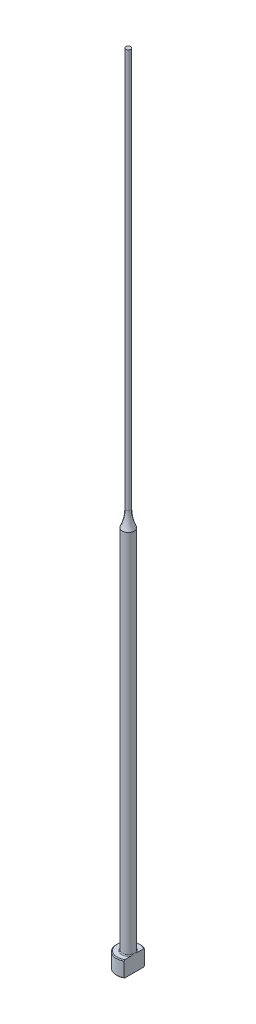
ISO-10303-21;
HEADER;
FILE_DESCRIPTION(('STEP AP214'),'2;1');
FILE_NAME('part.step','',(''),(''),'','','');
FILE_SCHEMA(('AUTOMOTIVE_DESIGN { 1 0 10303 214 1 1 1 1 }'));
ENDSEC;
DATA;
#1=APPLICATION_CONTEXT('core data for automotive mechanical design processes');
#2=APPLICATION_PROTOCOL_DEFINITION('international standard','automotive_design',2000,#1);
#3=PRODUCT_CONTEXT('',#1,'mechanical');
#4=PRODUCT('Part','Part','',(#3));
#5=PRODUCT_RELATED_PRODUCT_CATEGORY('part','',(#4));
#6=PRODUCT_DEFINITION_FORMATION('','',#4);
#7=PRODUCT_DEFINITION_CONTEXT('part definition',#1,'design');
#8=PRODUCT_DEFINITION('design','',#6,#7);
#9=PRODUCT_DEFINITION_SHAPE('','',#8);
#10=(LENGTH_UNIT() NAMED_UNIT(*) SI_UNIT(.MILLI.,.METRE.));
#11=(NAMED_UNIT(*) PLANE_ANGLE_UNIT() SI_UNIT($,.RADIAN.));
#12=(NAMED_UNIT(*) SI_UNIT($,.STERADIAN.) SOLID_ANGLE_UNIT());
#13=UNCERTAINTY_MEASURE_WITH_UNIT(LENGTH_MEASURE(1.E-05),#10,'distance_accuracy_value','');
#14=(GEOMETRIC_REPRESENTATION_CONTEXT(3) GLOBAL_UNCERTAINTY_ASSIGNED_CONTEXT((#13)) GLOBAL_UNIT_ASSIGNED_CONTEXT((#10,
#11,#12)) REPRESENTATION_CONTEXT('',''));
#15=CARTESIAN_POINT('',(0.,0.,0.));
#16=DIRECTION('',(0.,0.,1.));
#17=DIRECTION('',(1.,0.,0.));
#18=AXIS2_PLACEMENT_3D('',#15,#16,#17);
#19=CARTESIAN_POINT('',(-2.99999999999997,4.,0.));
#20=DIRECTION('',(0.,1.,0.));
#21=DIRECTION('',(0.,0.,1.));
#22=AXIS2_PLACEMENT_3D('',#19,#20,#21);
#23=PLANE('',#22);
#24=CARTESIAN_POINT('',(0.,4.,0.));
#25=DIRECTION('',(0.,1.,0.));
#26=DIRECTION('',(0.,0.,1.));
#27=AXIS2_PLACEMENT_3D('',#24,#25,#26);
#28=CIRCLE('',#27,2.79999999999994);
#29=CARTESIAN_POINT('',(1.49999999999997,4.,-2.36431808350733));
#30=VERTEX_POINT('',#29);
#31=CARTESIAN_POINT('',(1.49999999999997,4.,2.36431808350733));
#32=VERTEX_POINT('',#31);
#33=EDGE_CURVE('E187',#30,#32,#28,.T.);
#34=ORIENTED_EDGE('',*,*,#33,.T.);
#35=DIRECTION('',(0.,0.,-1.));
#36=VECTOR('',#35,1.);
#37=CARTESIAN_POINT('',(1.49999999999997,4.,0.));
#38=LINE('',#37,#36);
#39=CARTESIAN_POINT('',(1.49999999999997,3.99999999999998,0.799999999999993));
#40=VERTEX_POINT('',#39);
#41=EDGE_CURVE('E57',#32,#40,#38,.T.);
#42=ORIENTED_EDGE('',*,*,#41,.T.);
#43=CARTESIAN_POINT('',(0.,4.,0.));
#44=DIRECTION('',(0.,1.,0.));
#45=DIRECTION('',(0.,0.,1.));
#46=AXIS2_PLACEMENT_3D('',#43,#44,#45);
#47=CIRCLE('',#46,1.69999999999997);
#48=CARTESIAN_POINT('',(1.49999999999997,3.99999999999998,-0.799999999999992));
#49=VERTEX_POINT('',#48);
#50=EDGE_CURVE('E108',#40,#49,#47,.F.);
#51=ORIENTED_EDGE('',*,*,#50,.T.);
#52=EDGE_CURVE('E137',#49,#30,#38,.T.);
#53=ORIENTED_EDGE('',*,*,#52,.T.);
#54=EDGE_LOOP('',(#34,#42,#51,#53));
#55=FACE_BOUND('',#54,.T.);
#56=ADVANCED_FACE('F32',(#55),#23,.T.);
#57=CARTESIAN_POINT('',(0.,259.958771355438,0.));
#58=DIRECTION('',(0.,1.,0.));
#59=DIRECTION('',(0.,0.,1.));
#60=AXIS2_PLACEMENT_3D('',#57,#58,#59);
#61=CYLINDRICAL_SURFACE('',#60,2.99999999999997);
#62=CARTESIAN_POINT('',(0.,3.79999999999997,0.));
#63=DIRECTION('',(0.,1.,0.));
#64=DIRECTION('',(0.,0.,1.));
#65=AXIS2_PLACEMENT_3D('',#62,#63,#64);
#66=CIRCLE('',#65,2.99999999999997);
#67=CARTESIAN_POINT('',(1.49999999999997,3.79999999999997,2.5980762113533));
#68=VERTEX_POINT('',#67);
#69=CARTESIAN_POINT('',(1.49999999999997,3.79999999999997,-2.5980762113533));
#70=VERTEX_POINT('',#69);
#71=EDGE_CURVE('E105',#68,#70,#66,.F.);
#72=ORIENTED_EDGE('',*,*,#71,.T.);
#73=DIRECTION('',(0.,-1.,0.));
#74=VECTOR('',#73,1.);
#75=CARTESIAN_POINT('',(1.49999999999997,200.,-2.5980762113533));
#76=LINE('',#75,#74);
#77=CARTESIAN_POINT('',(1.49999999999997,0.200000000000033,-2.5980762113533));
#78=VERTEX_POINT('',#77);
#79=EDGE_CURVE('E193',#70,#78,#76,.T.);
#80=ORIENTED_EDGE('',*,*,#79,.T.);
#81=CARTESIAN_POINT('',(0.,0.200000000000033,0.));
#82=DIRECTION('',(0.,-1.,0.));
#83=DIRECTION('',(0.,0.,-1.));
#84=AXIS2_PLACEMENT_3D('',#81,#82,#83);
#85=CIRCLE('',#84,2.99999999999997);
#86=CARTESIAN_POINT('',(1.49999999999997,0.200000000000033,2.5980762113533));
#87=VERTEX_POINT('',#86);
#88=EDGE_CURVE('E100',#78,#87,#85,.F.);
#89=ORIENTED_EDGE('',*,*,#88,.T.);
#90=DIRECTION('',(0.,-1.,0.));
#91=VECTOR('',#90,1.);
#92=CARTESIAN_POINT('',(1.49999999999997,200.,2.5980762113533));
#93=LINE('',#92,#91);
#94=EDGE_CURVE('E93',#68,#87,#93,.T.);
#95=ORIENTED_EDGE('',*,*,#94,.F.);
#96=EDGE_LOOP('',(#72,#80,#89,#95));
#97=FACE_BOUND('',#96,.T.);
#98=ADVANCED_FACE('F158',(#97),#61,.T.);
#99=CARTESIAN_POINT('',(0.,0.,0.));
#100=DIRECTION('',(0.,-1.,0.));
#101=DIRECTION('',(0.,0.,-1.));
#102=AXIS2_PLACEMENT_3D('',#99,#100,#101);
#103=PLANE('',#102);
#104=CARTESIAN_POINT('',(0.,0.,0.));
#105=DIRECTION('',(0.,-1.,0.));
#106=DIRECTION('',(0.,0.,-1.));
#107=AXIS2_PLACEMENT_3D('',#104,#105,#106);
#108=CIRCLE('',#107,2.79999999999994);
#109=CARTESIAN_POINT('',(1.49999999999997,0.,2.36431808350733));
#110=VERTEX_POINT('',#109);
#111=CARTESIAN_POINT('',(1.49999999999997,0.,-2.36431808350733));
#112=VERTEX_POINT('',#111);
#113=EDGE_CURVE('E98',#110,#112,#108,.T.);
#114=ORIENTED_EDGE('',*,*,#113,.T.);
#115=DIRECTION('',(0.,0.,1.));
#116=VECTOR('',#115,1.);
#117=CARTESIAN_POINT('',(1.49999999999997,0.,2.5980762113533));
#118=LINE('',#117,#116);
#119=EDGE_CURVE('E83',#112,#110,#118,.T.);
#120=ORIENTED_EDGE('',*,*,#119,.T.);
#121=EDGE_LOOP('',(#114,#120));
#122=FACE_BOUND('',#121,.T.);
#123=ADVANCED_FACE('F103',(#122),#103,.T.);
#124=CARTESIAN_POINT('',(0.,4.,0.));
#125=DIRECTION('',(0.,-1.,0.));
#126=DIRECTION('',(0.,0.,-1.));
#127=AXIS2_PLACEMENT_3D('',#124,#125,#126);
#128=CONICAL_SURFACE('',#127,2.79999999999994,0.785398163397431);
#129=ORIENTED_EDGE('',*,*,#71,.F.);
#130=CARTESIAN_POINT('',(1.49999999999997,0.888258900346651,5.71827621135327));
#131=CARTESIAN_POINT('',(1.49999999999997,1.01361833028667,5.58866816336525));
#132=CARTESIAN_POINT('',(1.49999999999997,1.13884324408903,5.45892957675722));
#133=CARTESIAN_POINT('',(1.49999999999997,1.38894444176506,5.19911365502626));
#134=CARTESIAN_POINT('',(1.49999999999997,1.51382072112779,5.06903631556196));
#135=CARTESIAN_POINT('',(1.49999999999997,1.76320568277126,4.80840180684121));
#136=CARTESIAN_POINT('',(1.49999999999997,1.88771414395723,4.67784442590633));
#137=CARTESIAN_POINT('',(1.49999999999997,2.13618059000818,4.4162081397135));
#138=CARTESIAN_POINT('',(1.49999999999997,2.26013857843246,4.28512923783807));
#139=CARTESIAN_POINT('',(1.49999999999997,2.50488975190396,4.02490837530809));
#140=CARTESIAN_POINT('',(1.49999999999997,2.62569693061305,3.8957795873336));
#141=CARTESIAN_POINT('',(1.49999999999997,2.86640694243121,3.63668213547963));
#142=CARTESIAN_POINT('',(1.49999999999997,2.98630978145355,3.50671347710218));
#143=CARTESIAN_POINT('',(1.49999999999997,3.22486033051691,3.24567921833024));
#144=CARTESIAN_POINT('',(1.49999999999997,3.3435083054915,3.11461386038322));
#145=CARTESIAN_POINT('',(1.49999999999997,3.5790771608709,2.85094268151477));
#146=CARTESIAN_POINT('',(1.49999999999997,3.69599811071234,2.71833692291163));
#147=CARTESIAN_POINT('',(1.49999999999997,3.88262371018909,2.50255231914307));
#148=CARTESIAN_POINT('',(1.49999999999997,3.95312454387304,2.42006293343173));
#149=CARTESIAN_POINT('',(1.49999999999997,4.09287098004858,2.254010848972));
#150=CARTESIAN_POINT('',(1.49999999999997,4.16211645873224,2.17044804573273));
#151=CARTESIAN_POINT('',(1.49999999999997,4.29964684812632,2.00105967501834));
#152=CARTESIAN_POINT('',(1.49999999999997,4.36791386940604,1.9152195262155));
#153=CARTESIAN_POINT('',(1.49999999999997,4.50205840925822,1.7417139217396));
#154=CARTESIAN_POINT('',(1.49999999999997,4.56793649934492,1.65404891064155));
#155=CARTESIAN_POINT('',(1.49999999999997,4.69728151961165,1.47490236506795));
#156=CARTESIAN_POINT('',(1.49999999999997,4.76069661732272,1.38338308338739));
#157=CARTESIAN_POINT('',(1.49999999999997,4.88239539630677,1.19675661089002));
#158=CARTESIAN_POINT('',(1.49999999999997,4.94067201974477,1.10164473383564));
#159=CARTESIAN_POINT('',(1.49999999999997,5.048413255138,0.908008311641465));
#160=CARTESIAN_POINT('',(1.49999999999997,5.09797809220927,0.809540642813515));
#161=CARTESIAN_POINT('',(1.49999999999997,5.18432188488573,0.607192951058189));
#162=CARTESIAN_POINT('',(1.49999999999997,5.22114374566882,0.50333247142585));
#163=CARTESIAN_POINT('',(1.49999999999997,5.26099935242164,0.347577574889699));
#164=CARTESIAN_POINT('',(1.49999999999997,5.2715702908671,0.297609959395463));
#165=CARTESIAN_POINT('',(1.49999999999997,5.28794860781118,0.196885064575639));
#166=CARTESIAN_POINT('',(1.49999999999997,5.29375640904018,0.146127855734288));
#167=CARTESIAN_POINT('',(1.49999999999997,5.30019707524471,0.0444388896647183));
#168=CARTESIAN_POINT('',(1.49999999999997,5.30084594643,-0.00649183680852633));
#169=CARTESIAN_POINT('',(1.49999999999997,5.29696416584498,-0.108155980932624));
#170=CARTESIAN_POINT('',(1.49999999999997,5.29243308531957,-0.158889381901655));
#171=CARTESIAN_POINT('',(1.49999999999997,5.27856915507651,-0.259234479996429));
#172=CARTESIAN_POINT('',(1.49999999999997,5.2692782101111,-0.308852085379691));
#173=CARTESIAN_POINT('',(1.49999999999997,5.24647108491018,-0.407110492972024));
#174=CARTESIAN_POINT('',(1.49999999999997,5.23295324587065,-0.45575090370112));
#175=CARTESIAN_POINT('',(1.49999999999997,5.20226175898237,-0.55214996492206));
#176=CARTESIAN_POINT('',(1.49999999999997,5.18506801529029,-0.599902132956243));
#177=CARTESIAN_POINT('',(1.49999999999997,5.1477138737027,-0.694205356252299));
#178=CARTESIAN_POINT('',(1.49999999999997,5.12755408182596,-0.740756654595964));
#179=CARTESIAN_POINT('',(1.49999999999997,5.0632769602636,-0.879166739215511));
#180=CARTESIAN_POINT('',(1.49999999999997,5.01551721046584,-0.969329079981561));
#181=CARTESIAN_POINT('',(1.49999999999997,4.91367909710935,-1.14604316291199));
#182=CARTESIAN_POINT('',(1.49999999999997,4.85959300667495,-1.2325903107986));
#183=CARTESIAN_POINT('',(1.49999999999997,4.74697968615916,-1.40321348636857));
#184=CARTESIAN_POINT('',(1.49999999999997,4.68843573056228,-1.4872783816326));
#185=CARTESIAN_POINT('',(1.49999999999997,4.5684384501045,-1.65322187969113));
#186=CARTESIAN_POINT('',(1.49999999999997,4.50698656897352,-1.73510153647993));
#187=CARTESIAN_POINT('',(1.49999999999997,4.3811567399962,-1.89829823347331));
#188=CARTESIAN_POINT('',(1.49999999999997,4.31675092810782,-1.97959369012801));
#189=CARTESIAN_POINT('',(1.49999999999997,4.18634068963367,-2.14090082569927));
#190=CARTESIAN_POINT('',(1.49999999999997,4.12033609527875,-2.22091236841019));
#191=CARTESIAN_POINT('',(1.49999999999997,3.92086431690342,-2.45906508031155));
#192=CARTESIAN_POINT('',(1.49999999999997,3.78562663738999,-2.61572090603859));
#193=CARTESIAN_POINT('',(1.49999999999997,3.53554498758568,-2.90006295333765));
#194=CARTESIAN_POINT('',(1.49999999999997,3.42114543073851,-3.02814382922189));
#195=CARTESIAN_POINT('',(1.49999999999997,3.1909355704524,-3.28303767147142));
#196=CARTESIAN_POINT('',(1.49999999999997,3.07512522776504,-3.40985060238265));
#197=CARTESIAN_POINT('',(1.49999999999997,2.72597067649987,-3.78913849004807));
#198=CARTESIAN_POINT('',(1.49999999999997,2.49111760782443,-4.04022177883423));
#199=CARTESIAN_POINT('',(1.49999999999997,2.0288247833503,-4.52992803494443));
#200=CARTESIAN_POINT('',(1.49999999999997,1.80147747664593,-4.7686387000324));
#201=CARTESIAN_POINT('',(1.49999999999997,1.45954865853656,-5.12558036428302));
#202=CARTESIAN_POINT('',(1.49999999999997,1.34548484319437,-5.24430773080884));
#203=CARTESIAN_POINT('',(1.49999999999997,1.11707176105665,-5.48148573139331));
#204=CARTESIAN_POINT('',(1.49999999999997,1.00272249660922,-5.59993636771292));
#205=CARTESIAN_POINT('',(1.49999999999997,0.888258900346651,-5.71827621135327));
#206=B_SPLINE_CURVE_WITH_KNOTS('',3,(#130,#131,#132,#133,#134,#135,#136,#137,#138,#139,#140,
#141,#142,#143,#144,#145,#146,#147,#148,#149,#150,#151,#152,#153,#154,#155,#156,#157,#158,#159,
#160,#161,#162,#163,#164,#165,#166,#167,#168,#169,#170,#171,#172,#173,#174,#175,#176,#177,#178,
#179,#180,#181,#182,#183,#184,#185,#186,#187,#188,#189,#190,#191,#192,#193,#194,#195,#196,#197,
#198,#199,#200,#201,#202,#203,#204,#205),.UNSPECIFIED.,.F.,.F.,(4,2,2,2,2,2,2,2,2,2,2,2,2,2,2,2,
2,2,2,2,2,2,2,2,2,2,2,2,2,2,2,2,2,2,2,2,2,4),(0.,0.540943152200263,1.08189327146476,
1.62312052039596,2.16434426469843,2.69482920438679,3.22531067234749,3.75567781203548,
4.28602356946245,4.611550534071,4.9371094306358,5.26610945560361,5.59503024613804,
5.92894782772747,6.26331713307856,6.59354403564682,6.92264800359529,7.07567478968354,
7.22868799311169,7.38122626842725,7.53377717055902,7.68500755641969,7.83629736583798,
7.988436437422,8.14054446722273,8.44618799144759,8.75220879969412,9.05944044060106,
9.36652111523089,9.6776428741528,9.98879742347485,10.609592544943,11.1247803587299,
11.6399825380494,12.6713544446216,13.6603005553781,14.1542238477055,14.6481430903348),.UNSPECIFIED.);
#207=EDGE_CURVE('E136',#68,#32,#206,.T.);
#208=ORIENTED_EDGE('',*,*,#207,.T.);
#209=ORIENTED_EDGE('',*,*,#33,.F.);
#210=EDGE_CURVE('E128',#30,#70,#206,.T.);
#211=ORIENTED_EDGE('',*,*,#210,.T.);
#212=EDGE_LOOP('',(#129,#208,#209,#211));
#213=FACE_BOUND('',#212,.T.);
#214=ADVANCED_FACE('F144',(#213),#128,.T.);
#215=CARTESIAN_POINT('',(0.,0.200000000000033,0.));
#216=DIRECTION('',(0.,1.,0.));
#217=DIRECTION('',(0.,0.,1.));
#218=AXIS2_PLACEMENT_3D('',#215,#216,#217);
#219=CONICAL_SURFACE('',#218,2.99999999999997,0.785398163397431);
#220=ORIENTED_EDGE('',*,*,#88,.F.);
#221=CARTESIAN_POINT('',(1.49999999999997,3.11174109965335,-5.71827621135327));
#222=CARTESIAN_POINT('',(1.49999999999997,2.98638166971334,-5.58866816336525));
#223=CARTESIAN_POINT('',(1.49999999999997,2.86115675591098,-5.45892957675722));
#224=CARTESIAN_POINT('',(1.49999999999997,2.61105555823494,-5.19911365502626));
#225=CARTESIAN_POINT('',(1.49999999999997,2.48617927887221,-5.06903631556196));
#226=CARTESIAN_POINT('',(1.49999999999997,2.23679431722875,-4.80840180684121));
#227=CARTESIAN_POINT('',(1.49999999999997,2.11228585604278,-4.67784442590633));
#228=CARTESIAN_POINT('',(1.49999999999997,1.86381940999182,-4.4162081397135));
#229=CARTESIAN_POINT('',(1.49999999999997,1.73986142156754,-4.28512923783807));
#230=CARTESIAN_POINT('',(1.49999999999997,1.49511024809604,-4.02490837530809));
#231=CARTESIAN_POINT('',(1.49999999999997,1.37430306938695,-3.8957795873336));
#232=CARTESIAN_POINT('',(1.49999999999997,1.13359305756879,-3.63668213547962));
#233=CARTESIAN_POINT('',(1.49999999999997,1.01369021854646,-3.50671347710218));
#234=CARTESIAN_POINT('',(1.49999999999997,0.775139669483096,-3.24567921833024));
#235=CARTESIAN_POINT('',(1.49999999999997,0.656491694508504,-3.11461386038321));
#236=CARTESIAN_POINT('',(1.49999999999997,0.420922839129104,-2.85094268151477));
#237=CARTESIAN_POINT('',(1.49999999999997,0.304001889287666,-2.71833692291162));
#238=CARTESIAN_POINT('',(1.49999999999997,0.117376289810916,-2.50255231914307));
#239=CARTESIAN_POINT('',(1.49999999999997,0.0468754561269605,-2.42006293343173));
#240=CARTESIAN_POINT('',(1.49999999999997,-0.0928709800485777,-2.254010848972));
#241=CARTESIAN_POINT('',(1.49999999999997,-0.162116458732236,-2.17044804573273));
#242=CARTESIAN_POINT('',(1.49999999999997,-0.299646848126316,-2.00105967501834));
#243=CARTESIAN_POINT('',(1.49999999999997,-0.367913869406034,-1.9152195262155));
#244=CARTESIAN_POINT('',(1.49999999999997,-0.502058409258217,-1.7417139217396));
#245=CARTESIAN_POINT('',(1.49999999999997,-0.567936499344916,-1.65404891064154));
#246=CARTESIAN_POINT('',(1.49999999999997,-0.697281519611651,-1.47490236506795));
#247=CARTESIAN_POINT('',(1.49999999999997,-0.760696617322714,-1.38338308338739));
#248=CARTESIAN_POINT('',(1.49999999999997,-0.882395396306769,-1.19675661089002));
#249=CARTESIAN_POINT('',(1.49999999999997,-0.940672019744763,-1.10164473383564));
#250=CARTESIAN_POINT('',(1.49999999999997,-1.048413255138,-0.908008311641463));
#251=CARTESIAN_POINT('',(1.49999999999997,-1.09797809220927,-0.809540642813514));
#252=CARTESIAN_POINT('',(1.49999999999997,-1.18432188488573,-0.607192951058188));
#253=CARTESIAN_POINT('',(1.49999999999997,-1.22114374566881,-0.503332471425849));
#254=CARTESIAN_POINT('',(1.49999999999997,-1.26099935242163,-0.347577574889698));
#255=CARTESIAN_POINT('',(1.49999999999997,-1.2715702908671,-0.297609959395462));
#256=CARTESIAN_POINT('',(1.49999999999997,-1.28794860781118,-0.196885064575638));
#257=CARTESIAN_POINT('',(1.49999999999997,-1.29375640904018,-0.146127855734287));
#258=CARTESIAN_POINT('',(1.49999999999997,-1.30019707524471,-0.0444388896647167));
#259=CARTESIAN_POINT('',(1.49999999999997,-1.30084594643,0.00649183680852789));
#260=CARTESIAN_POINT('',(1.49999999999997,-1.29696416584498,0.108155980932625));
#261=CARTESIAN_POINT('',(1.49999999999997,-1.29243308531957,0.158889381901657));
#262=CARTESIAN_POINT('',(1.49999999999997,-1.2785691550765,0.259234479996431));
#263=CARTESIAN_POINT('',(1.49999999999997,-1.2692782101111,0.308852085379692));
#264=CARTESIAN_POINT('',(1.49999999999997,-1.24647108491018,0.407110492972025));
#265=CARTESIAN_POINT('',(1.49999999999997,-1.23295324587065,0.455750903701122));
#266=CARTESIAN_POINT('',(1.49999999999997,-1.20226175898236,0.552149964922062));
#267=CARTESIAN_POINT('',(1.49999999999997,-1.18506801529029,0.599902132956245));
#268=CARTESIAN_POINT('',(1.49999999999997,-1.14771387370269,0.694205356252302));
#269=CARTESIAN_POINT('',(1.49999999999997,-1.12755408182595,0.740756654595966));
#270=CARTESIAN_POINT('',(1.49999999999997,-1.0632769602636,0.879166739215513));
#271=CARTESIAN_POINT('',(1.49999999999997,-1.01551721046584,0.969329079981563));
#272=CARTESIAN_POINT('',(1.49999999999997,-0.913679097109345,1.14604316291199));
#273=CARTESIAN_POINT('',(1.49999999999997,-0.859593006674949,1.2325903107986));
#274=CARTESIAN_POINT('',(1.49999999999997,-0.746979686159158,1.40321348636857));
#275=CARTESIAN_POINT('',(1.49999999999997,-0.688435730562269,1.4872783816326));
#276=CARTESIAN_POINT('',(1.49999999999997,-0.568438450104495,1.65322187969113));
#277=CARTESIAN_POINT('',(1.49999999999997,-0.506986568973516,1.73510153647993));
#278=CARTESIAN_POINT('',(1.49999999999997,-0.381156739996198,1.89829823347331));
#279=CARTESIAN_POINT('',(1.49999999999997,-0.316750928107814,1.97959369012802));
#280=CARTESIAN_POINT('',(1.49999999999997,-0.186340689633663,2.14090082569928));
#281=CARTESIAN_POINT('',(1.49999999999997,-0.12033609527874,2.22091236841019));
#282=CARTESIAN_POINT('',(1.49999999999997,0.0791356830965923,2.45906508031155));
#283=CARTESIAN_POINT('',(1.49999999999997,0.214373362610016,2.61572090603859));
#284=CARTESIAN_POINT('',(1.49999999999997,0.46445501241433,2.90006295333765));
#285=CARTESIAN_POINT('',(1.49999999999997,0.578854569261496,3.02814382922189));
#286=CARTESIAN_POINT('',(1.49999999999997,0.809064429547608,3.28303767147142));
#287=CARTESIAN_POINT('',(1.49999999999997,0.924874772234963,3.40985060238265));
#288=CARTESIAN_POINT('',(1.49999999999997,1.27402932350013,3.78913849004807));
#289=CARTESIAN_POINT('',(1.49999999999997,1.50888239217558,4.04022177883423));
#290=CARTESIAN_POINT('',(1.49999999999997,1.97117521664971,4.52992803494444));
#291=CARTESIAN_POINT('',(1.49999999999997,2.19852252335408,4.76863870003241));
#292=CARTESIAN_POINT('',(1.49999999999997,2.54045134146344,5.12558036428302));
#293=CARTESIAN_POINT('',(1.49999999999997,2.65451515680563,5.24430773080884));
#294=CARTESIAN_POINT('',(1.49999999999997,2.88292823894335,5.48148573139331));
#295=CARTESIAN_POINT('',(1.49999999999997,2.99727750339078,5.59993636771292));
#296=CARTESIAN_POINT('',(1.49999999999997,3.11174109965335,5.71827621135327));
#297=B_SPLINE_CURVE_WITH_KNOTS('',3,(#221,#222,#223,#224,#225,#226,#227,#228,#229,#230,#231,
#232,#233,#234,#235,#236,#237,#238,#239,#240,#241,#242,#243,#244,#245,#246,#247,#248,#249,#250,
#251,#252,#253,#254,#255,#256,#257,#258,#259,#260,#261,#262,#263,#264,#265,#266,#267,#268,#269,
#270,#271,#272,#273,#274,#275,#276,#277,#278,#279,#280,#281,#282,#283,#284,#285,#286,#287,#288,
#289,#290,#291,#292,#293,#294,#295,#296),.UNSPECIFIED.,.F.,.F.,(4,2,2,2,2,2,2,2,2,2,2,2,2,2,2,2,
2,2,2,2,2,2,2,2,2,2,2,2,2,2,2,2,2,2,2,2,2,4),(0.,0.540943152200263,1.08189327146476,
1.62312052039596,2.16434426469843,2.69482920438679,3.22531067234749,3.75567781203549,
4.28602356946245,4.611550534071,4.9371094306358,5.26610945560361,5.59503024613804,
5.92894782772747,6.26331713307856,6.59354403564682,6.92264800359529,7.07567478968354,
7.2286879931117,7.38122626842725,7.53377717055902,7.6850075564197,7.83629736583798,
7.98843643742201,8.14054446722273,8.44618799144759,8.75220879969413,9.05944044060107,
9.3665211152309,9.6776428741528,9.98879742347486,10.609592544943,11.1247803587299,
11.6399825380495,12.6713544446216,13.6603005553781,14.1542238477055,14.6481430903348),.UNSPECIFIED.);
#298=EDGE_CURVE('E86',#78,#112,#297,.T.);
#299=ORIENTED_EDGE('',*,*,#298,.T.);
#300=ORIENTED_EDGE('',*,*,#113,.F.);
#301=EDGE_CURVE('E89',#110,#87,#297,.T.);
#302=ORIENTED_EDGE('',*,*,#301,.T.);
#303=EDGE_LOOP('',(#220,#299,#300,#302));
#304=FACE_BOUND('',#303,.T.);
#305=ADVANCED_FACE('F97',(#304),#219,.T.);
#306=CARTESIAN_POINT('',(0.,4.19999999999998,0.));
#307=DIRECTION('',(0.,1.,0.));
#308=DIRECTION('',(0.,0.,1.));
#309=AXIS2_PLACEMENT_3D('',#306,#307,#308);
#310=TOROIDAL_SURFACE('',#309,1.69999999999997,0.2);
#311=CARTESIAN_POINT('',(1.49999999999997,4.19999999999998,0.));
#312=CARTESIAN_POINT('',(1.49999999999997,4.20000050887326,7.14686674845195E-11));
#313=CARTESIAN_POINT('',(1.49999999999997,4.20000101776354,-1.21663673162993E-07));
#314=CARTESIAN_POINT('',(1.49999999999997,4.20000199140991,-4.97616237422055E-07));
#315=CARTESIAN_POINT('',(1.49999999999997,4.20000245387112,-7.56516220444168E-07));
#316=CARTESIAN_POINT('',(1.49999999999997,4.20000338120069,-1.37642837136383E-06));
#317=CARTESIAN_POINT('',(1.49999999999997,4.20000384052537,-1.74563476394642E-06));
#318=CARTESIAN_POINT('',(1.49999999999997,4.20000469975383,-2.53565984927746E-06));
#319=CARTESIAN_POINT('',(1.49999999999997,4.20000510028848,-2.95582597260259E-06));
#320=CARTESIAN_POINT('',(1.49999999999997,4.20000646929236,-4.48430445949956E-06));
#321=CARTESIAN_POINT('',(1.49999999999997,4.20000736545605,-5.6586103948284E-06));
#322=CARTESIAN_POINT('',(1.49999999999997,4.20000893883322,-8.06479202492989E-06));
#323=CARTESIAN_POINT('',(1.49999999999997,4.20000962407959,-9.29170517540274E-06));
#324=CARTESIAN_POINT('',(1.49999999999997,4.20001225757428,-1.416232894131E-05));
#325=CARTESIAN_POINT('',(1.49999999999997,4.20001407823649,-1.78790031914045E-05));
#326=CARTESIAN_POINT('',(1.49999999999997,4.20001699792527,-2.51443066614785E-05));
#327=CARTESIAN_POINT('',(1.49999999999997,4.20001815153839,-2.86715394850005E-05));
#328=CARTESIAN_POINT('',(1.49999999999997,4.20002315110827,-4.39218128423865E-05));
#329=CARTESIAN_POINT('',(1.49999999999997,4.20002701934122,-5.56288390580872E-05));
#330=CARTESIAN_POINT('',(1.49999999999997,4.20003312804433,-7.7405829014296E-05));
#331=CARTESIAN_POINT('',(1.49999999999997,4.20003553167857,-8.74278412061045E-05));
#332=CARTESIAN_POINT('',(1.49999999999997,4.20005483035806,-0.000161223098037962));
#333=CARTESIAN_POINT('',(1.49999999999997,4.20007979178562,-0.000222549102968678));
#334=CARTESIAN_POINT('',(1.49999999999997,4.20017391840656,-0.000462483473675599));
#335=CARTESIAN_POINT('',(1.49999999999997,4.20023706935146,-0.000642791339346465));
#336=CARTESIAN_POINT('',(1.49999999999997,4.20048761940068,-0.00134785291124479));
#337=CARTESIAN_POINT('',(1.49999999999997,4.20068132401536,-0.00187087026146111));
#338=CARTESIAN_POINT('',(1.49999999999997,4.20147357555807,-0.00402004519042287));
#339=CARTESIAN_POINT('',(1.49999999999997,4.20206499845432,-0.0056481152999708));
#340=CARTESIAN_POINT('',(1.49999999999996,4.20892634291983,-0.0245232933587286));
#341=CARTESIAN_POINT('',(1.49999999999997,4.21523683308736,-0.041759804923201));
#342=CARTESIAN_POINT('',(1.49999999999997,4.22755028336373,-0.0756091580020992));
#343=CARTESIAN_POINT('',(1.49999999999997,4.23355589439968,-0.0922211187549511));
#344=CARTESIAN_POINT('',(1.49999999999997,4.24620101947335,-0.127454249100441));
#345=CARTESIAN_POINT('',(1.49999999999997,4.25283080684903,-0.146078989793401));
#346=CARTESIAN_POINT('',(1.49999999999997,4.26599765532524,-0.183577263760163));
#347=CARTESIAN_POINT('',(1.49999999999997,4.27253305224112,-0.202451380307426));
#348=CARTESIAN_POINT('',(1.49999999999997,4.28834228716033,-0.248982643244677));
#349=CARTESIAN_POINT('',(1.49999999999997,4.2974915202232,-0.276682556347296));
#350=CARTESIAN_POINT('',(1.49999999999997,4.31490935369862,-0.331625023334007));
#351=CARTESIAN_POINT('',(1.49999999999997,4.3231938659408,-0.358862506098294));
#352=CARTESIAN_POINT('',(1.49999999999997,4.34051594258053,-0.419125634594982));
#353=CARTESIAN_POINT('',(1.49999999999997,4.34936607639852,-0.452206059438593));
#354=CARTESIAN_POINT('',(1.49999999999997,4.36549583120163,-0.519023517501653));
#355=CARTESIAN_POINT('',(1.49999999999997,4.37276283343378,-0.552763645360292));
#356=CARTESIAN_POINT('',(1.49999999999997,4.38554755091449,-0.62305310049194));
#357=CARTESIAN_POINT('',(1.49999999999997,4.39090573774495,-0.65963271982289));
#358=CARTESIAN_POINT('',(1.49999999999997,4.39825016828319,-0.733028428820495));
#359=CARTESIAN_POINT('',(1.49999999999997,4.40024734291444,-0.76984335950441));
#360=CARTESIAN_POINT('',(1.49999999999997,4.39970780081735,-0.842856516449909));
#361=CARTESIAN_POINT('',(1.49999999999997,4.39725347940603,-0.879053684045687));
#362=CARTESIAN_POINT('',(1.49999999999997,4.38900085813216,-0.93238076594));
#363=CARTESIAN_POINT('',(1.49999999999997,4.38553049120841,-0.949868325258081));
#364=CARTESIAN_POINT('',(1.49999999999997,4.37678336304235,-0.984374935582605));
#365=CARTESIAN_POINT('',(1.49999999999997,4.37150943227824,-1.00139467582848));
#366=CARTESIAN_POINT('',(1.49999999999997,4.35869781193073,-1.03479423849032));
#367=CARTESIAN_POINT('',(1.49999999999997,4.3511359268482,-1.05116499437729));
#368=CARTESIAN_POINT('',(1.49999999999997,4.33325333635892,-1.08234828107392));
#369=CARTESIAN_POINT('',(1.49999999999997,4.32294266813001,-1.09716621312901));
#370=CARTESIAN_POINT('',(1.49999999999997,4.30512758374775,-1.11714173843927));
#371=CARTESIAN_POINT('',(1.49999999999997,4.29884721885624,-1.12339066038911));
#372=CARTESIAN_POINT('',(1.49999999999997,4.28545950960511,-1.13494695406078));
#373=CARTESIAN_POINT('',(1.49999999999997,4.27835226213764,-1.14025443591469));
#374=CARTESIAN_POINT('',(1.49999999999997,4.26325970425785,-1.14967631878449));
#375=CARTESIAN_POINT('',(1.49999999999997,4.25526534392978,-1.15377649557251));
#376=CARTESIAN_POINT('',(1.49999999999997,4.23863207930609,-1.16034952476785));
#377=CARTESIAN_POINT('',(1.49999999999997,4.22999427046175,-1.16282507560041));
#378=CARTESIAN_POINT('',(1.49999999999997,4.21343922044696,-1.16570267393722));
#379=CARTESIAN_POINT('',(1.49999999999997,4.20555896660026,-1.16631687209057));
#380=CARTESIAN_POINT('',(1.49999999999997,4.18982775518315,-1.16602054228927));
#381=CARTESIAN_POINT('',(1.49999999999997,4.18197679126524,-1.16511036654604));
#382=CARTESIAN_POINT('',(1.49999999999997,4.16747846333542,-1.16204446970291));
#383=CARTESIAN_POINT('',(1.49999999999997,4.16079696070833,-1.16004509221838));
#384=CARTESIAN_POINT('',(1.49999999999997,4.14781700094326,-1.15505972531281));
#385=CARTESIAN_POINT('',(1.49999999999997,4.14151862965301,-1.1520735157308));
#386=CARTESIAN_POINT('',(1.49999999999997,4.12690214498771,-1.14387585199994));
#387=CARTESIAN_POINT('',(1.49999999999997,4.11881436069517,-1.13825400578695));
#388=CARTESIAN_POINT('',(1.49999999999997,4.1036444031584,-1.12578441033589));
#389=CARTESIAN_POINT('',(1.49999999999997,4.09656475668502,-1.11893367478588));
#390=CARTESIAN_POINT('',(1.49999999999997,4.08012297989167,-1.10074342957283));
#391=CARTESIAN_POINT('',(1.49999999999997,4.07136543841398,-1.08886044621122));
#392=CARTESIAN_POINT('',(1.49999999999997,4.05578194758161,-1.06392743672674));
#393=CARTESIAN_POINT('',(1.49999999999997,4.0489571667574,-1.05087671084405));
#394=CARTESIAN_POINT('',(1.49999999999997,4.03273856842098,-1.01472307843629));
#395=CARTESIAN_POINT('',(1.49999999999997,4.02486230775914,-0.990945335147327));
#396=CARTESIAN_POINT('',(1.49999999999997,4.01257693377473,-0.94232199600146));
#397=CARTESIAN_POINT('',(1.49999999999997,4.00820590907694,-0.917467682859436));
#398=CARTESIAN_POINT('',(1.49999999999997,4.00229956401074,-0.867912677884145));
#399=CARTESIAN_POINT('',(1.49999999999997,4.0007128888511,-0.843217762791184));
#400=CARTESIAN_POINT('',(1.49999999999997,3.9996723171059,-0.79374605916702));
#401=CARTESIAN_POINT('',(1.49999999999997,4.0002230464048,-0.768969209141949));
#402=CARTESIAN_POINT('',(1.49999999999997,4.00433101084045,-0.696994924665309));
#403=CARTESIAN_POINT('',(1.49999999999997,4.01016976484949,-0.64993124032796));
#404=CARTESIAN_POINT('',(1.49999999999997,4.02567776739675,-0.559166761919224));
#405=CARTESIAN_POINT('',(1.49999999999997,4.03511950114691,-0.515423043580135));
#406=CARTESIAN_POINT('',(1.49999999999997,4.05693059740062,-0.427590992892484));
#407=CARTESIAN_POINT('',(1.49999999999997,4.06936356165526,-0.383518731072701));
#408=CARTESIAN_POINT('',(1.49999999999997,4.09174953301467,-0.310161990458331));
#409=CARTESIAN_POINT('',(1.49999999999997,4.10119843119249,-0.280718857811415));
#410=CARTESIAN_POINT('',(1.49999999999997,4.12060442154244,-0.22234098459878));
#411=CARTESIAN_POINT('',(1.49999999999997,4.13055519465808,-0.193404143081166));
#412=CARTESIAN_POINT('',(1.49999999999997,4.14973721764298,-0.138756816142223));
#413=CARTESIAN_POINT('',(1.49999999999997,4.15893123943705,-0.113033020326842));
#414=CARTESIAN_POINT('',(1.49999999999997,4.17788037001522,-0.0606351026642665));
#415=CARTESIAN_POINT('',(1.49999999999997,4.18764328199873,-0.0339636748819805));
#416=CARTESIAN_POINT('',(1.49999999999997,4.19793548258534,-0.00564657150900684));
#417=CARTESIAN_POINT('',(1.49999999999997,4.19852751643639,-0.00401699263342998));
#418=CARTESIAN_POINT('',(1.49999999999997,4.1993199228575,-0.0018674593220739));
#419=CARTESIAN_POINT('',(1.49999999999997,4.19951319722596,-0.00134559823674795));
#420=CARTESIAN_POINT('',(1.49999999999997,4.19976322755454,-0.000641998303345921));
#421=CARTESIAN_POINT('',(1.49999999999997,4.19982627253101,-0.000461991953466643));
#422=CARTESIAN_POINT('',(1.49999999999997,4.19992025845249,-0.000222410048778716));
#423=CARTESIAN_POINT('',(1.49999999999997,4.19994519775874,-0.000161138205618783));
#424=CARTESIAN_POINT('',(1.49999999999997,4.19996448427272,-8.74039267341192E-05));
#425=CARTESIAN_POINT('',(1.49999999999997,4.19996688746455,-7.73857556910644E-05));
#426=CARTESIAN_POINT('',(1.49999999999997,4.1999729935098,-5.56173272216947E-05));
#427=CARTESIAN_POINT('',(1.49999999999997,4.19997685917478,-4.39149186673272E-05));
#428=CARTESIAN_POINT('',(1.49999999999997,4.19998185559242,-2.86698156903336E-05));
#429=CARTESIAN_POINT('',(1.49999999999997,4.19998300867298,-2.51431575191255E-05));
#430=CARTESIAN_POINT('',(1.49999999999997,4.19998592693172,-1.78789552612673E-05));
#431=CARTESIAN_POINT('',(1.49999999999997,4.19998774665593,-1.41627846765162E-05));
#432=CARTESIAN_POINT('',(1.49999999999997,4.19999037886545,-9.29264488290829E-06));
#433=CARTESIAN_POINT('',(1.49999999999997,4.19999106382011,-8.06577599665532E-06));
#434=CARTESIAN_POINT('',(1.49999999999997,4.19999263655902,-5.65962639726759E-06));
#435=CARTESIAN_POINT('',(1.49999999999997,4.19999353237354,-4.48530466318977E-06));
#436=CARTESIAN_POINT('',(1.49999999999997,4.19999490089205,-2.95673740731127E-06));
#437=CARTESIAN_POINT('',(1.49999999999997,4.1999953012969,-2.53653208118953E-06));
#438=CARTESIAN_POINT('',(1.49999999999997,4.19999616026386,-1.74640525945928E-06));
#439=CARTESIAN_POINT('',(1.49999999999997,4.19999661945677,-1.37713598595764E-06));
#440=CARTESIAN_POINT('',(1.49999999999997,4.19999754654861,-7.57072336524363E-07));
#441=CARTESIAN_POINT('',(1.49999999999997,4.19999800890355,-4.9808738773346E-07));
#442=CARTESIAN_POINT('',(1.49999999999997,4.19999898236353,-1.21927249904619E-07));
#443=CARTESIAN_POINT('',(1.49999999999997,4.19999949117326,-7.14621294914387E-11));
#444=CARTESIAN_POINT('',(1.49999999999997,4.19999999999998,0.));
#445=B_SPLINE_CURVE_WITH_KNOTS('',3,(#311,#312,#313,#314,#315,#316,#317,#318,#319,#320,#321,
#322,#323,#324,#325,#326,#327,#328,#329,#330,#331,#332,#333,#334,#335,#336,#337,#338,#339,#340,
#341,#342,#343,#344,#345,#346,#347,#348,#349,#350,#351,#352,#353,#354,#355,#356,#357,#358,#359,
#360,#361,#362,#363,#364,#365,#366,#367,#368,#369,#370,#371,#372,#373,#374,#375,#376,#377,#378,
#379,#380,#381,#382,#383,#384,#385,#386,#387,#388,#389,#390,#391,#392,#393,#394,#395,#396,#397,
#398,#399,#400,#401,#402,#403,#404,#405,#406,#407,#408,#409,#410,#411,#412,#413,#414,#415,#416,
#417,#418,#419,#420,#421,#422,#423,#424,#425,#426,#427,#428,#429,#430,#431,#432,#433,#434,#435,
#436,#437,#438,#439,#440,#441,#442,#443,#444),.UNSPECIFIED.,.T.,.F.,(4,2,2,2,2,2,2,2,2,2,2,2,2,
2,2,2,2,2,2,2,2,2,2,2,2,2,2,2,2,2,2,2,2,2,2,2,2,2,2,2,2,2,2,2,2,2,2,2,2,2,2,2,2,2,2,2,2,2,2,2,2,
2,2,2,2,2,4),(0.,1.5268750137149E-06,3.10959387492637E-06,4.86976756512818E-06,
6.60940084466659E-06,1.10202525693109E-05,1.5232779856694E-05,2.7614037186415E-05,
3.87351645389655E-05,7.57188332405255E-05,0.000106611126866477,0.000304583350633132,
0.00087827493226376,0.00255078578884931,0.0077480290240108,0.0628090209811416,0.115802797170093,
0.175110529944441,0.23503061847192,0.32253950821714,0.407938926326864,0.510638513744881,
0.614128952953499,0.724918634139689,0.835347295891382,0.943752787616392,0.997165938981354,
1.05049564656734,1.10441029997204,1.15813071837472,1.18463966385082,1.21114550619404,
1.23795217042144,1.26471419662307,1.2882832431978,1.31184684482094,1.33268332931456,
1.35352446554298,1.38290826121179,1.41236445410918,1.45639976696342,1.50046164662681,
1.57518788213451,1.65071550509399,1.72483484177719,1.79911468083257,1.94105061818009,
2.07520625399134,2.2125154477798,2.30527614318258,2.39707056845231,2.47902409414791,
2.56422207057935,2.56942417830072,2.57109299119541,2.57166572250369,2.57186352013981,
2.57189440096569,2.57193136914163,2.57194248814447,2.57195486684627,2.57195907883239,
2.57196348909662,2.57196522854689,2.57196698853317,2.57196857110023,2.57197009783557),.UNSPECIFIED.);
#446=CARTESIAN_POINT('',(1.49999999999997,4.19999999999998,0.));
#447=VERTEX_POINT('',#446);
#448=EDGE_CURVE('E11',#49,#447,#445,.T.);
#449=ORIENTED_EDGE('',*,*,#448,.F.);
#450=ORIENTED_EDGE('',*,*,#50,.F.);
#451=CARTESIAN_POINT('',(1.49999999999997,4.19999999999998,0.));
#452=CARTESIAN_POINT('',(1.49999999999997,4.1999994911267,-7.1468641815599E-11));
#453=CARTESIAN_POINT('',(1.49999999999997,4.19999898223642,1.21663673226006E-07));
#454=CARTESIAN_POINT('',(1.49999999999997,4.19999800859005,4.97616237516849E-07));
#455=CARTESIAN_POINT('',(1.49999999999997,4.19999754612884,7.56516220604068E-07));
#456=CARTESIAN_POINT('',(1.49999999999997,4.19999661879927,1.37642837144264E-06));
#457=CARTESIAN_POINT('',(1.49999999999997,4.1999961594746,1.74563476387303E-06));
#458=CARTESIAN_POINT('',(1.49999999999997,4.19999530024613,2.5356598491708E-06));
#459=CARTESIAN_POINT('',(1.49999999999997,4.19999489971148,2.95582597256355E-06));
#460=CARTESIAN_POINT('',(1.49999999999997,4.1999935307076,4.48430445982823E-06));
#461=CARTESIAN_POINT('',(1.49999999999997,4.19999263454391,5.6586103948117E-06));
#462=CARTESIAN_POINT('',(1.49999999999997,4.19999106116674,8.06479202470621E-06));
#463=CARTESIAN_POINT('',(1.49999999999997,4.19999037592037,9.29170517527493E-06));
#464=CARTESIAN_POINT('',(1.49999999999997,4.19998774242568,1.41623289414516E-05));
#465=CARTESIAN_POINT('',(1.49999999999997,4.19998592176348,1.78790031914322E-05));
#466=CARTESIAN_POINT('',(1.49999999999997,4.1999830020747,2.51443066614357E-05));
#467=CARTESIAN_POINT('',(1.49999999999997,4.19998184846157,2.86715394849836E-05));
#468=CARTESIAN_POINT('',(1.49999999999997,4.1999768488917,4.39218128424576E-05));
#469=CARTESIAN_POINT('',(1.49999999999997,4.19997298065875,5.56288390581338E-05));
#470=CARTESIAN_POINT('',(1.49999999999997,4.19996687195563,7.7405829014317E-05));
#471=CARTESIAN_POINT('',(1.49999999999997,4.19996446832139,8.74278412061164E-05));
#472=CARTESIAN_POINT('',(1.49999999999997,4.1999451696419,0.000161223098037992));
#473=CARTESIAN_POINT('',(1.49999999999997,4.19992020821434,0.000222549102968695));
#474=CARTESIAN_POINT('',(1.49999999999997,4.19982608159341,0.000462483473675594));
#475=CARTESIAN_POINT('',(1.49999999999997,4.1997629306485,0.000642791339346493));
#476=CARTESIAN_POINT('',(1.49999999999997,4.19951238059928,0.00134785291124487));
#477=CARTESIAN_POINT('',(1.49999999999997,4.19931867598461,0.00187087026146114));
#478=CARTESIAN_POINT('',(1.49999999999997,4.19852642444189,0.00402004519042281));
#479=CARTESIAN_POINT('',(1.49999999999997,4.19793500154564,0.00564811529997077));
#480=CARTESIAN_POINT('',(1.49999999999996,4.19107365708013,0.0245232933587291));
#481=CARTESIAN_POINT('',(1.49999999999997,4.1847631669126,0.0417598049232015));
#482=CARTESIAN_POINT('',(1.49999999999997,4.17244971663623,0.0756091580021));
#483=CARTESIAN_POINT('',(1.49999999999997,4.16644410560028,0.0922211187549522));
#484=CARTESIAN_POINT('',(1.49999999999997,4.15379898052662,0.127454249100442));
#485=CARTESIAN_POINT('',(1.49999999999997,4.14716919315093,0.146078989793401));
#486=CARTESIAN_POINT('',(1.49999999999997,4.13400234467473,0.183577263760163));
#487=CARTESIAN_POINT('',(1.49999999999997,4.12746694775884,0.202451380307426));
#488=CARTESIAN_POINT('',(1.49999999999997,4.11165771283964,0.248982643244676));
#489=CARTESIAN_POINT('',(1.49999999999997,4.10250847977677,0.276682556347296));
#490=CARTESIAN_POINT('',(1.49999999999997,4.08509064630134,0.331625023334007));
#491=CARTESIAN_POINT('',(1.49999999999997,4.07680613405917,0.358862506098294));
#492=CARTESIAN_POINT('',(1.49999999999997,4.05948405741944,0.419125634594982));
#493=CARTESIAN_POINT('',(1.49999999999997,4.05063392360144,0.452206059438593));
#494=CARTESIAN_POINT('',(1.49999999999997,4.03450416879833,0.519023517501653));
#495=CARTESIAN_POINT('',(1.49999999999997,4.02723716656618,0.552763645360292));
#496=CARTESIAN_POINT('',(1.49999999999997,4.01445244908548,0.62305310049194));
#497=CARTESIAN_POINT('',(1.49999999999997,4.00909426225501,0.659632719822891));
#498=CARTESIAN_POINT('',(1.49999999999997,4.00174983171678,0.733028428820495));
#499=CARTESIAN_POINT('',(1.49999999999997,3.99975265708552,0.76984335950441));
#500=CARTESIAN_POINT('',(1.49999999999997,4.00029219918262,0.842856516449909));
#501=CARTESIAN_POINT('',(1.49999999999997,4.00274652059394,0.879053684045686));
#502=CARTESIAN_POINT('',(1.49999999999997,4.0109991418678,0.93238076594));
#503=CARTESIAN_POINT('',(1.49999999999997,4.01446950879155,0.949868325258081));
#504=CARTESIAN_POINT('',(1.49999999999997,4.02321663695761,0.984374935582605));
#505=CARTESIAN_POINT('',(1.49999999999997,4.02849056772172,1.00139467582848));
#506=CARTESIAN_POINT('',(1.49999999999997,4.04130218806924,1.03479423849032));
#507=CARTESIAN_POINT('',(1.49999999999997,4.04886407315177,1.05116499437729));
#508=CARTESIAN_POINT('',(1.49999999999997,4.06674666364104,1.08234828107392));
#509=CARTESIAN_POINT('',(1.49999999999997,4.07705733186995,1.09716621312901));
#510=CARTESIAN_POINT('',(1.49999999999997,4.09487241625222,1.11714173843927));
#511=CARTESIAN_POINT('',(1.49999999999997,4.10115278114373,1.12339066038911));
#512=CARTESIAN_POINT('',(1.49999999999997,4.11454049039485,1.13494695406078));
#513=CARTESIAN_POINT('',(1.49999999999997,4.12164773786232,1.14025443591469));
#514=CARTESIAN_POINT('',(1.49999999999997,4.13674029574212,1.14967631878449));
#515=CARTESIAN_POINT('',(1.49999999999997,4.14473465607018,1.15377649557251));
#516=CARTESIAN_POINT('',(1.49999999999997,4.16136792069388,1.16034952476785));
#517=CARTESIAN_POINT('',(1.49999999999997,4.17000572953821,1.16282507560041));
#518=CARTESIAN_POINT('',(1.49999999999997,4.186560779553,1.16570267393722));
#519=CARTESIAN_POINT('',(1.49999999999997,4.1944410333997,1.16631687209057));
#520=CARTESIAN_POINT('',(1.49999999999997,4.21017224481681,1.16602054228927));
#521=CARTESIAN_POINT('',(1.49999999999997,4.21802320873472,1.16511036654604));
#522=CARTESIAN_POINT('',(1.49999999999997,4.23252153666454,1.16204446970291));
#523=CARTESIAN_POINT('',(1.49999999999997,4.23920303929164,1.16004509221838));
#524=CARTESIAN_POINT('',(1.49999999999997,4.2521829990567,1.15505972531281));
#525=CARTESIAN_POINT('',(1.49999999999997,4.25848137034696,1.1520735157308));
#526=CARTESIAN_POINT('',(1.49999999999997,4.27309785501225,1.14387585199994));
#527=CARTESIAN_POINT('',(1.49999999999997,4.28118563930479,1.13825400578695));
#528=CARTESIAN_POINT('',(1.49999999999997,4.29635559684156,1.12578441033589));
#529=CARTESIAN_POINT('',(1.49999999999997,4.30343524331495,1.11893367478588));
#530=CARTESIAN_POINT('',(1.49999999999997,4.31987702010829,1.10074342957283));
#531=CARTESIAN_POINT('',(1.49999999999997,4.32863456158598,1.08886044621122));
#532=CARTESIAN_POINT('',(1.49999999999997,4.34421805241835,1.06392743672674));
#533=CARTESIAN_POINT('',(1.49999999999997,4.35104283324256,1.05087671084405));
#534=CARTESIAN_POINT('',(1.49999999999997,4.36726143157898,1.01472307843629));
#535=CARTESIAN_POINT('',(1.49999999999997,4.37513769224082,0.990945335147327));
#536=CARTESIAN_POINT('',(1.49999999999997,4.38742306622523,0.94232199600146));
#537=CARTESIAN_POINT('',(1.49999999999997,4.39179409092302,0.917467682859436));
#538=CARTESIAN_POINT('',(1.49999999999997,4.39770043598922,0.867912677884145));
#539=CARTESIAN_POINT('',(1.49999999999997,4.39928711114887,0.843217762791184));
#540=CARTESIAN_POINT('',(1.49999999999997,4.40032768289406,0.79374605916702));
#541=CARTESIAN_POINT('',(1.49999999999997,4.39977695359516,0.768969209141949));
#542=CARTESIAN_POINT('',(1.49999999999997,4.39566898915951,0.696994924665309));
#543=CARTESIAN_POINT('',(1.49999999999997,4.38983023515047,0.64993124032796));
#544=CARTESIAN_POINT('',(1.49999999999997,4.37432223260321,0.559166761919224));
#545=CARTESIAN_POINT('',(1.49999999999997,4.36488049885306,0.515423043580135));
#546=CARTESIAN_POINT('',(1.49999999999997,4.34306940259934,0.427590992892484));
#547=CARTESIAN_POINT('',(1.49999999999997,4.33063643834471,0.383518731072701));
#548=CARTESIAN_POINT('',(1.49999999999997,4.30825046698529,0.310161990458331));
#549=CARTESIAN_POINT('',(1.49999999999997,4.29880156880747,0.280718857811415));
#550=CARTESIAN_POINT('',(1.49999999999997,4.27939557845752,0.22234098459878));
#551=CARTESIAN_POINT('',(1.49999999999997,4.26944480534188,0.193404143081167));
#552=CARTESIAN_POINT('',(1.49999999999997,4.25026278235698,0.138756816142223));
#553=CARTESIAN_POINT('',(1.49999999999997,4.24106876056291,0.113033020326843));
#554=CARTESIAN_POINT('',(1.49999999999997,4.22211962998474,0.0606351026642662));
#555=CARTESIAN_POINT('',(1.49999999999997,4.21235671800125,0.0339636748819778));
#556=CARTESIAN_POINT('',(1.49999999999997,4.20206451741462,0.00564657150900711));
#557=CARTESIAN_POINT('',(1.49999999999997,4.20147248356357,0.00401699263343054));
#558=CARTESIAN_POINT('',(1.49999999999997,4.20068007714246,0.00186745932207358));
#559=CARTESIAN_POINT('',(1.49999999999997,4.200486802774,0.00134559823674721));
#560=CARTESIAN_POINT('',(1.49999999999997,4.20023677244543,0.000641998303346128));
#561=CARTESIAN_POINT('',(1.49999999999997,4.20017372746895,0.000461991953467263));
#562=CARTESIAN_POINT('',(1.49999999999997,4.20007974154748,0.000222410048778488));
#563=CARTESIAN_POINT('',(1.49999999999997,4.20005480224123,0.000161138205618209));
#564=CARTESIAN_POINT('',(1.49999999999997,4.20003551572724,8.74039267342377E-05));
#565=CARTESIAN_POINT('',(1.49999999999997,4.20003311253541,7.73857556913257E-05));
#566=CARTESIAN_POINT('',(1.49999999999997,4.20002700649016,5.56173272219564E-05));
#567=CARTESIAN_POINT('',(1.49999999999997,4.20002314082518,4.39149186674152E-05));
#568=CARTESIAN_POINT('',(1.49999999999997,4.20001814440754,2.86698156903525E-05));
#569=CARTESIAN_POINT('',(1.49999999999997,4.20001699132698,2.51431575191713E-05));
#570=CARTESIAN_POINT('',(1.49999999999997,4.20001407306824,1.78789552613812E-05));
#571=CARTESIAN_POINT('',(1.49999999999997,4.20001225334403,1.41627846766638E-05));
#572=CARTESIAN_POINT('',(1.49999999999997,4.20000962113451,9.29264488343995E-06));
#573=CARTESIAN_POINT('',(1.49999999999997,4.20000893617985,8.06577599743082E-06));
#574=CARTESIAN_POINT('',(1.49999999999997,4.20000736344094,5.65962639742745E-06));
#575=CARTESIAN_POINT('',(1.49999999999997,4.20000646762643,4.4853046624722E-06));
#576=CARTESIAN_POINT('',(1.49999999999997,4.20000509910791,2.95673740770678E-06));
#577=CARTESIAN_POINT('',(1.49999999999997,4.20000469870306,2.53653208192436E-06));
#578=CARTESIAN_POINT('',(1.49999999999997,4.2000038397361,1.74640526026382E-06));
#579=CARTESIAN_POINT('',(1.49999999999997,4.20000338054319,1.37713598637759E-06));
#580=CARTESIAN_POINT('',(1.49999999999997,4.20000245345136,7.5707233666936E-07));
#581=CARTESIAN_POINT('',(1.49999999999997,4.20000199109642,4.98087387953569E-07));
#582=CARTESIAN_POINT('',(1.49999999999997,4.20000101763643,1.2192725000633E-07));
#583=CARTESIAN_POINT('',(1.49999999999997,4.20000050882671,7.14621038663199E-11));
#584=CARTESIAN_POINT('',(1.49999999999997,4.19999999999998,0.));
#585=B_SPLINE_CURVE_WITH_KNOTS('',3,(#451,#452,#453,#454,#455,#456,#457,#458,#459,#460,#461,
#462,#463,#464,#465,#466,#467,#468,#469,#470,#471,#472,#473,#474,#475,#476,#477,#478,#479,#480,
#481,#482,#483,#484,#485,#486,#487,#488,#489,#490,#491,#492,#493,#494,#495,#496,#497,#498,#499,
#500,#501,#502,#503,#504,#505,#506,#507,#508,#509,#510,#511,#512,#513,#514,#515,#516,#517,#518,
#519,#520,#521,#522,#523,#524,#525,#526,#527,#528,#529,#530,#531,#532,#533,#534,#535,#536,#537,
#538,#539,#540,#541,#542,#543,#544,#545,#546,#547,#548,#549,#550,#551,#552,#553,#554,#555,#556,
#557,#558,#559,#560,#561,#562,#563,#564,#565,#566,#567,#568,#569,#570,#571,#572,#573,#574,#575,
#576,#577,#578,#579,#580,#581,#582,#583,#584),.UNSPECIFIED.,.T.,.F.,(4,2,2,2,2,2,2,2,2,2,2,2,2,
2,2,2,2,2,2,2,2,2,2,2,2,2,2,2,2,2,2,2,2,2,2,2,2,2,2,2,2,2,2,2,2,2,2,2,2,2,2,2,2,2,2,2,2,2,2,2,2,
2,2,2,2,2,4),(0.,1.5268750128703E-06,3.10959387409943E-06,4.86976756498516E-06,
6.60940084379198E-06,1.10202525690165E-05,1.52327798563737E-05,2.76140371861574E-05,
3.87351645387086E-05,7.57188332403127E-05,0.000106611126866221,0.000304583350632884,
0.000878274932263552,0.00255078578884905,0.00774802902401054,0.062809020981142,
0.115802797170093,0.175110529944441,0.235030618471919,0.32253950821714,0.407938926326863,
0.510638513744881,0.614128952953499,0.72491863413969,0.835347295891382,0.943752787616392,
0.997165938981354,1.05049564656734,1.10441029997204,1.15813071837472,1.18463966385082,
1.21114550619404,1.23795217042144,1.26471419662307,1.2882832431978,1.31184684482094,
1.33268332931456,1.35352446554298,1.38290826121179,1.41236445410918,1.45639976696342,
1.50046164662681,1.57518788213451,1.65071550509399,1.72483484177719,1.79911468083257,
1.94105061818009,2.07520625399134,2.2125154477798,2.30527614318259,2.39707056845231,
2.47902409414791,2.56422207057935,2.56942417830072,2.57109299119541,2.57166572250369,
2.57186352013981,2.57189440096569,2.57193136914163,2.57194248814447,2.57195486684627,
2.57195907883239,2.57196348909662,2.57196522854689,2.57196698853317,2.57196857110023,
2.57197009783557),.UNSPECIFIED.);
#586=EDGE_CURVE('E46',#447,#40,#585,.T.);
#587=ORIENTED_EDGE('',*,*,#586,.F.);
#588=CARTESIAN_POINT('',(0.,4.19999999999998,0.));
#589=DIRECTION('',(0.,1.,0.));
#590=DIRECTION('',(0.,0.,1.));
#591=AXIS2_PLACEMENT_3D('',#588,#589,#590);
#592=CIRCLE('',#591,1.49999999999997);
#593=EDGE_CURVE('E104',#447,#447,#592,.T.);
#594=ORIENTED_EDGE('',*,*,#593,.F.);
#595=EDGE_LOOP('',(#449,#450,#587,#594));
#596=FACE_BOUND('',#595,.T.);
#597=ADVANCED_FACE('F34',(#596),#310,.F.);
#598=CARTESIAN_POINT('',(-0.599999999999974,200.,0.));
#599=DIRECTION('',(0.,1.,0.));
#600=DIRECTION('',(0.,0.,1.));
#601=AXIS2_PLACEMENT_3D('',#598,#599,#600);
#602=PLANE('',#601);
#603=CARTESIAN_POINT('',(0.,200.,0.));
#604=DIRECTION('',(0.,1.,0.));
#605=DIRECTION('',(0.,0.,1.));
#606=AXIS2_PLACEMENT_3D('',#603,#604,#605);
#607=CIRCLE('',#606,0.599999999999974);
#608=CARTESIAN_POINT('',(0.,200.,0.599999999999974));
#609=VERTEX_POINT('',#608);
#610=EDGE_CURVE('E186',#609,#609,#607,.T.);
#611=ORIENTED_EDGE('',*,*,#610,.T.);
#612=EDGE_LOOP('',(#611));
#613=FACE_BOUND('',#612,.T.);
#614=ADVANCED_FACE('F149',(#613),#602,.T.);
#615=CARTESIAN_POINT('',(0.,259.958771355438,0.));
#616=DIRECTION('',(0.,1.,0.));
#617=DIRECTION('',(0.,0.,1.));
#618=AXIS2_PLACEMENT_3D('',#615,#616,#617);
#619=CYLINDRICAL_SURFACE('',#618,0.599999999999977);
#620=CARTESIAN_POINT('',(0.,100.,0.));
#621=DIRECTION('',(0.,1.,0.));
#622=DIRECTION('',(0.,0.,1.));
#623=AXIS2_PLACEMENT_3D('',#620,#621,#622);
#624=CIRCLE('',#623,0.599999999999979);
#625=CARTESIAN_POINT('',(0.,100.,0.599999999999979));
#626=VERTEX_POINT('',#625);
#627=EDGE_CURVE('E183',#626,#626,#624,.T.);
#628=ORIENTED_EDGE('',*,*,#627,.T.);
#629=EDGE_LOOP('',(#628));
#630=FACE_BOUND('',#629,.T.);
#631=ORIENTED_EDGE('',*,*,#610,.F.);
#632=EDGE_LOOP('',(#631));
#633=FACE_BOUND('',#632,.T.);
#634=ADVANCED_FACE('F172',(#630,#633),#619,.T.);
#635=CARTESIAN_POINT('',(0.,100.,0.));
#636=DIRECTION('',(0.,1.,0.));
#637=DIRECTION('',(0.,0.,1.));
#638=AXIS2_PLACEMENT_3D('',#635,#636,#637);
#639=TOROIDAL_SURFACE('',#638,10.6,9.99999999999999);
#640=CARTESIAN_POINT('',(0.,95.8539175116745,0.));
#641=DIRECTION('',(0.,1.,0.));
#642=DIRECTION('',(0.,0.,1.));
#643=AXIS2_PLACEMENT_3D('',#640,#641,#642);
#644=CIRCLE('',#643,1.49999999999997);
#645=CARTESIAN_POINT('',(0.,95.8539175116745,1.49999999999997));
#646=VERTEX_POINT('',#645);
#647=EDGE_CURVE('E101',#646,#646,#644,.T.);
#648=ORIENTED_EDGE('',*,*,#647,.T.);
#649=EDGE_LOOP('',(#648));
#650=FACE_BOUND('',#649,.T.);
#651=ORIENTED_EDGE('',*,*,#627,.F.);
#652=EDGE_LOOP('',(#651));
#653=FACE_BOUND('',#652,.T.);
#654=ADVANCED_FACE('F169',(#650,#653),#639,.F.);
#655=CARTESIAN_POINT('',(0.,259.958771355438,0.));
#656=DIRECTION('',(0.,1.,0.));
#657=DIRECTION('',(0.,0.,1.));
#658=AXIS2_PLACEMENT_3D('',#655,#656,#657);
#659=CYLINDRICAL_SURFACE('',#658,1.49999999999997);
#660=ORIENTED_EDGE('',*,*,#593,.T.);
#661=EDGE_LOOP('',(#660));
#662=FACE_BOUND('',#661,.T.);
#663=ORIENTED_EDGE('',*,*,#647,.F.);
#664=EDGE_LOOP('',(#663));
#665=FACE_BOUND('',#664,.T.);
#666=ADVANCED_FACE('F122',(#662,#665),#659,.T.);
#667=CARTESIAN_POINT('',(1.49999999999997,200.,2.5980762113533));
#668=DIRECTION('',(1.,0.,0.));
#669=DIRECTION('',(0.,0.,-1.));
#670=AXIS2_PLACEMENT_3D('',#667,#668,#669);
#671=PLANE('',#670);
#672=ORIENTED_EDGE('',*,*,#79,.F.);
#673=ORIENTED_EDGE('',*,*,#210,.F.);
#674=ORIENTED_EDGE('',*,*,#52,.F.);
#675=ORIENTED_EDGE('',*,*,#448,.T.);
#676=ORIENTED_EDGE('',*,*,#586,.T.);
#677=ORIENTED_EDGE('',*,*,#41,.F.);
#678=ORIENTED_EDGE('',*,*,#207,.F.);
#679=ORIENTED_EDGE('',*,*,#94,.T.);
#680=ORIENTED_EDGE('',*,*,#301,.F.);
#681=ORIENTED_EDGE('',*,*,#119,.F.);
#682=ORIENTED_EDGE('',*,*,#298,.F.);
#683=EDGE_LOOP('',(#672,#673,#674,#675,#676,#677,#678,#679,#680,#681,#682));
#684=FACE_BOUND('',#683,.T.);
#685=ADVANCED_FACE('F85',(#684),#671,.T.);
#686=CLOSED_SHELL('',(#56,#98,#123,#214,#305,#597,#614,#634,#654,#666,#685));
#687=MANIFOLD_SOLID_BREP('B2',#686);
#688=ADVANCED_BREP_SHAPE_REPRESENTATION('',(#18,#687),#14);
#689=SHAPE_DEFINITION_REPRESENTATION(#9,#688);
ENDSEC;
END-ISO-10303-21;
